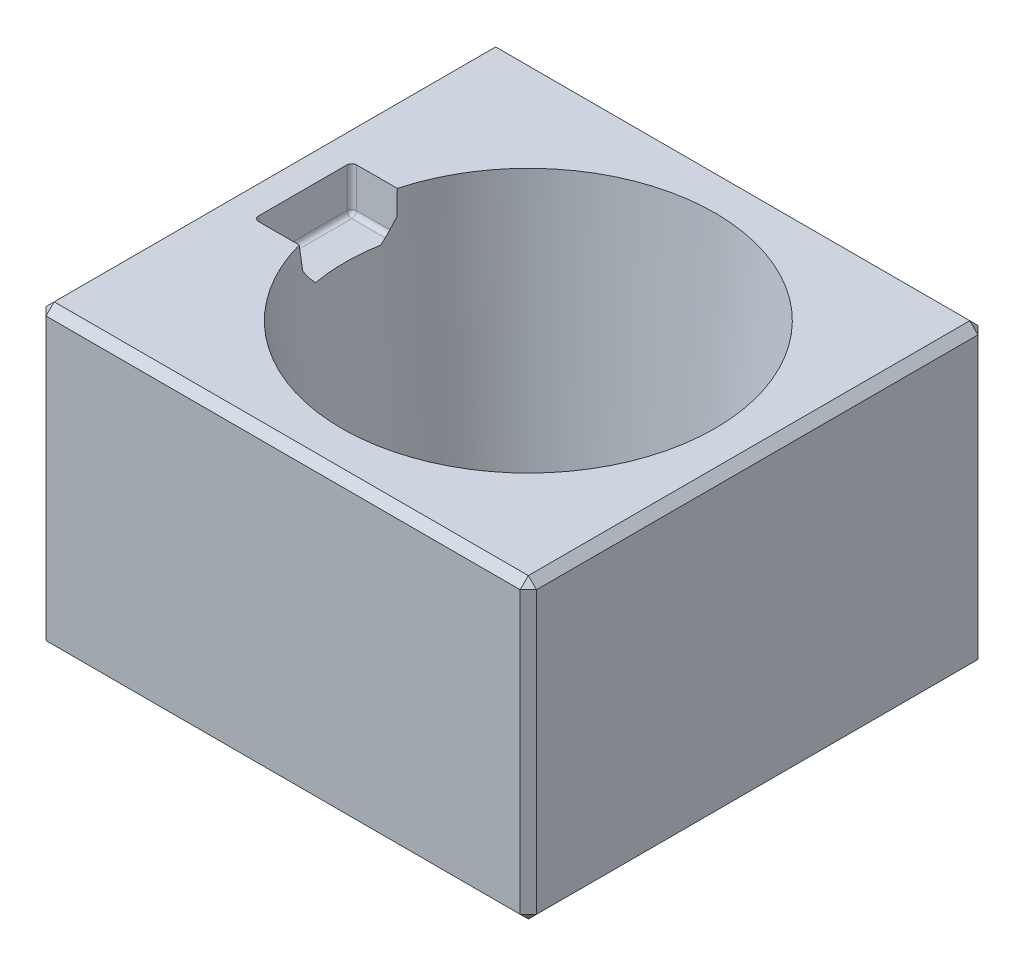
ISO-10303-21;
HEADER;
FILE_DESCRIPTION(('STEP AP214'),'2;1');
FILE_NAME('part.step','',(''),(''),'','','');
FILE_SCHEMA(('AUTOMOTIVE_DESIGN { 1 0 10303 214 1 1 1 1 }'));
ENDSEC;
DATA;
#1=APPLICATION_CONTEXT('core data for automotive mechanical design processes');
#2=APPLICATION_PROTOCOL_DEFINITION('international standard','automotive_design',2000,#1);
#3=PRODUCT_CONTEXT('',#1,'mechanical');
#4=PRODUCT('Part','Part','',(#3));
#5=PRODUCT_RELATED_PRODUCT_CATEGORY('part','',(#4));
#6=PRODUCT_DEFINITION_FORMATION('','',#4);
#7=PRODUCT_DEFINITION_CONTEXT('part definition',#1,'design');
#8=PRODUCT_DEFINITION('design','',#6,#7);
#9=PRODUCT_DEFINITION_SHAPE('','',#8);
#10=(LENGTH_UNIT() NAMED_UNIT(*) SI_UNIT(.MILLI.,.METRE.));
#11=(NAMED_UNIT(*) PLANE_ANGLE_UNIT() SI_UNIT($,.RADIAN.));
#12=(NAMED_UNIT(*) SI_UNIT($,.STERADIAN.) SOLID_ANGLE_UNIT());
#13=UNCERTAINTY_MEASURE_WITH_UNIT(LENGTH_MEASURE(1.E-05),#10,'distance_accuracy_value','');
#14=(GEOMETRIC_REPRESENTATION_CONTEXT(3) GLOBAL_UNCERTAINTY_ASSIGNED_CONTEXT((#13)) GLOBAL_UNIT_ASSIGNED_CONTEXT((#10,
#11,#12)) REPRESENTATION_CONTEXT('',''));
#15=CARTESIAN_POINT('',(0.,0.,0.));
#16=DIRECTION('',(0.,0.,1.));
#17=DIRECTION('',(1.,0.,0.));
#18=AXIS2_PLACEMENT_3D('',#15,#16,#17);
#19=CARTESIAN_POINT('',(140.,-100.971659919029,140.));
#20=DIRECTION('',(1.,0.,0.));
#21=DIRECTION('',(0.,1.,0.));
#22=AXIS2_PLACEMENT_3D('',#19,#20,#21);
#23=PLANE('',#22);
#24=DIRECTION('',(0.,-1.,0.));
#25=VECTOR('',#24,1.);
#26=CARTESIAN_POINT('',(140.,-100.971659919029,135.));
#27=LINE('',#26,#25);
#28=CARTESIAN_POINT('',(140.,75.9716599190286,135.));
#29=VERTEX_POINT('',#28);
#30=CARTESIAN_POINT('',(140.,-95.9716599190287,135.));
#31=VERTEX_POINT('',#30);
#32=EDGE_CURVE('E41',#29,#31,#27,.T.);
#33=ORIENTED_EDGE('',*,*,#32,.T.);
#34=DIRECTION('',(0.,0.,-1.));
#35=VECTOR('',#34,1.);
#36=CARTESIAN_POINT('',(140.,-95.9716599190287,-140.));
#37=LINE('',#36,#35);
#38=CARTESIAN_POINT('',(140.,-95.9716599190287,-135.));
#39=VERTEX_POINT('',#38);
#40=EDGE_CURVE('E11',#31,#39,#37,.T.);
#41=ORIENTED_EDGE('',*,*,#40,.T.);
#42=DIRECTION('',(0.,1.,0.));
#43=VECTOR('',#42,1.);
#44=CARTESIAN_POINT('',(140.,-100.971659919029,-135.));
#45=LINE('',#44,#43);
#46=CARTESIAN_POINT('',(140.,75.9716599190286,-135.));
#47=VERTEX_POINT('',#46);
#48=EDGE_CURVE('E383',#39,#47,#45,.T.);
#49=ORIENTED_EDGE('',*,*,#48,.T.);
#50=DIRECTION('',(0.,0.,1.));
#51=VECTOR('',#50,1.);
#52=CARTESIAN_POINT('',(140.,75.9716599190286,140.));
#53=LINE('',#52,#51);
#54=EDGE_CURVE('E52',#47,#29,#53,.T.);
#55=ORIENTED_EDGE('',*,*,#54,.T.);
#56=EDGE_LOOP('',(#33,#41,#49,#55));
#57=FACE_BOUND('',#56,.T.);
#58=ADVANCED_FACE('F32',(#57),#23,.T.);
#59=CARTESIAN_POINT('',(140.,-100.971659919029,140.));
#60=DIRECTION('',(0.,0.,1.));
#61=DIRECTION('',(1.,0.,0.));
#62=AXIS2_PLACEMENT_3D('',#59,#60,#61);
#63=PLANE('',#62);
#64=DIRECTION('',(-1.,0.,0.));
#65=VECTOR('',#64,1.);
#66=CARTESIAN_POINT('',(-160.,75.9716599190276,140.));
#67=LINE('',#66,#65);
#68=CARTESIAN_POINT('',(135.,75.9716599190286,140.));
#69=VERTEX_POINT('',#68);
#70=CARTESIAN_POINT('',(-155.,75.9716599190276,140.));
#71=VERTEX_POINT('',#70);
#72=EDGE_CURVE('E374',#69,#71,#67,.T.);
#73=ORIENTED_EDGE('',*,*,#72,.T.);
#74=DIRECTION('',(0.,-1.,0.));
#75=VECTOR('',#74,1.);
#76=CARTESIAN_POINT('',(-155.,-100.971659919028,140.));
#77=LINE('',#76,#75);
#78=CARTESIAN_POINT('',(-155.,-95.9716599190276,140.));
#79=VERTEX_POINT('',#78);
#80=EDGE_CURVE('E380',#71,#79,#77,.T.);
#81=ORIENTED_EDGE('',*,*,#80,.T.);
#82=DIRECTION('',(1.,0.,0.));
#83=VECTOR('',#82,1.);
#84=CARTESIAN_POINT('',(140.,-95.9716599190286,140.));
#85=LINE('',#84,#83);
#86=CARTESIAN_POINT('',(135.,-95.9716599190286,140.));
#87=VERTEX_POINT('',#86);
#88=EDGE_CURVE('E378',#79,#87,#85,.T.);
#89=ORIENTED_EDGE('',*,*,#88,.T.);
#90=DIRECTION('',(0.,1.,0.));
#91=VECTOR('',#90,1.);
#92=CARTESIAN_POINT('',(135.,-100.971659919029,140.));
#93=LINE('',#92,#91);
#94=EDGE_CURVE('E376',#87,#69,#93,.T.);
#95=ORIENTED_EDGE('',*,*,#94,.T.);
#96=EDGE_LOOP('',(#73,#81,#89,#95));
#97=FACE_BOUND('',#96,.T.);
#98=ADVANCED_FACE('F460',(#97),#63,.T.);
#99=CARTESIAN_POINT('',(-160.,-100.971659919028,140.));
#100=DIRECTION('',(-1.,0.,0.));
#101=DIRECTION('',(0.,-1.,0.));
#102=AXIS2_PLACEMENT_3D('',#99,#100,#101);
#103=PLANE('',#102);
#104=DIRECTION('',(0.,-1.,0.));
#105=VECTOR('',#104,1.);
#106=CARTESIAN_POINT('',(-160.,-100.971659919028,-135.));
#107=LINE('',#106,#105);
#108=CARTESIAN_POINT('',(-160.,75.9716599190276,-135.));
#109=VERTEX_POINT('',#108);
#110=CARTESIAN_POINT('',(-160.,-95.9716599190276,-135.));
#111=VERTEX_POINT('',#110);
#112=EDGE_CURVE('E342',#109,#111,#107,.T.);
#113=ORIENTED_EDGE('',*,*,#112,.T.);
#114=DIRECTION('',(0.,0.,1.));
#115=VECTOR('',#114,1.);
#116=CARTESIAN_POINT('',(-160.,-95.9716599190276,140.));
#117=LINE('',#116,#115);
#118=CARTESIAN_POINT('',(-160.,-95.9716599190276,135.));
#119=VERTEX_POINT('',#118);
#120=EDGE_CURVE('E344',#111,#119,#117,.T.);
#121=ORIENTED_EDGE('',*,*,#120,.T.);
#122=DIRECTION('',(0.,1.,0.));
#123=VECTOR('',#122,1.);
#124=CARTESIAN_POINT('',(-160.,-100.971659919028,135.));
#125=LINE('',#124,#123);
#126=CARTESIAN_POINT('',(-160.,75.9716599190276,135.));
#127=VERTEX_POINT('',#126);
#128=EDGE_CURVE('E320',#119,#127,#125,.T.);
#129=ORIENTED_EDGE('',*,*,#128,.T.);
#130=DIRECTION('',(0.,0.,-1.));
#131=VECTOR('',#130,1.);
#132=CARTESIAN_POINT('',(-160.,75.9716599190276,-140.));
#133=LINE('',#132,#131);
#134=EDGE_CURVE('E340',#127,#109,#133,.T.);
#135=ORIENTED_EDGE('',*,*,#134,.T.);
#136=EDGE_LOOP('',(#113,#121,#129,#135));
#137=FACE_BOUND('',#136,.T.);
#138=ADVANCED_FACE('F541',(#137),#103,.T.);
#139=CARTESIAN_POINT('',(140.,-100.971659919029,-140.));
#140=DIRECTION('',(0.,0.,-1.));
#141=DIRECTION('',(-1.,0.,0.));
#142=AXIS2_PLACEMENT_3D('',#139,#140,#141);
#143=PLANE('',#142);
#144=DIRECTION('',(-1.,0.,0.));
#145=VECTOR('',#144,1.);
#146=CARTESIAN_POINT('',(-160.,-95.9716599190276,-140.));
#147=LINE('',#146,#145);
#148=CARTESIAN_POINT('',(135.,-95.9716599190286,-140.));
#149=VERTEX_POINT('',#148);
#150=CARTESIAN_POINT('',(-155.,-95.9716599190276,-140.));
#151=VERTEX_POINT('',#150);
#152=EDGE_CURVE('E360',#149,#151,#147,.T.);
#153=ORIENTED_EDGE('',*,*,#152,.T.);
#154=DIRECTION('',(0.,1.,0.));
#155=VECTOR('',#154,1.);
#156=CARTESIAN_POINT('',(-155.,-100.971659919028,-140.));
#157=LINE('',#156,#155);
#158=CARTESIAN_POINT('',(-155.,75.9716599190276,-140.));
#159=VERTEX_POINT('',#158);
#160=EDGE_CURVE('E362',#151,#159,#157,.T.);
#161=ORIENTED_EDGE('',*,*,#160,.T.);
#162=DIRECTION('',(1.,0.,0.));
#163=VECTOR('',#162,1.);
#164=CARTESIAN_POINT('',(140.000000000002,75.9716599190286,-140.));
#165=LINE('',#164,#163);
#166=CARTESIAN_POINT('',(135.,75.9716599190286,-140.));
#167=VERTEX_POINT('',#166);
#168=EDGE_CURVE('E356',#159,#167,#165,.T.);
#169=ORIENTED_EDGE('',*,*,#168,.T.);
#170=DIRECTION('',(0.,-1.,0.));
#171=VECTOR('',#170,1.);
#172=CARTESIAN_POINT('',(135.,-100.971659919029,-140.));
#173=LINE('',#172,#171);
#174=EDGE_CURVE('E358',#167,#149,#173,.T.);
#175=ORIENTED_EDGE('',*,*,#174,.T.);
#176=EDGE_LOOP('',(#153,#161,#169,#175));
#177=FACE_BOUND('',#176,.T.);
#178=ADVANCED_FACE('F489',(#177),#143,.T.);
#179=CARTESIAN_POINT('',(140.,-100.971659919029,-140.));
#180=DIRECTION('',(0.,1.,0.));
#181=DIRECTION('',(-1.,0.,0.));
#182=AXIS2_PLACEMENT_3D('',#179,#180,#181);
#183=PLANE('',#182);
#184=DIRECTION('',(0.,0.,1.));
#185=VECTOR('',#184,1.);
#186=CARTESIAN_POINT('',(135.,-100.971659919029,140.));
#187=LINE('',#186,#185);
#188=CARTESIAN_POINT('',(135.,-100.971659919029,-135.));
#189=VERTEX_POINT('',#188);
#190=CARTESIAN_POINT('',(135.,-100.971659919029,135.));
#191=VERTEX_POINT('',#190);
#192=EDGE_CURVE('E349',#189,#191,#187,.T.);
#193=ORIENTED_EDGE('',*,*,#192,.T.);
#194=DIRECTION('',(-1.,0.,0.));
#195=VECTOR('',#194,1.);
#196=CARTESIAN_POINT('',(-160.,-100.971659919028,135.));
#197=LINE('',#196,#195);
#198=CARTESIAN_POINT('',(-155.,-100.971659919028,135.));
#199=VERTEX_POINT('',#198);
#200=EDGE_CURVE('E354',#191,#199,#197,.T.);
#201=ORIENTED_EDGE('',*,*,#200,.T.);
#202=DIRECTION('',(0.,0.,-1.));
#203=VECTOR('',#202,1.);
#204=CARTESIAN_POINT('',(-155.,-100.971659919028,-140.));
#205=LINE('',#204,#203);
#206=CARTESIAN_POINT('',(-155.,-100.971659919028,-135.));
#207=VERTEX_POINT('',#206);
#208=EDGE_CURVE('E351',#199,#207,#205,.T.);
#209=ORIENTED_EDGE('',*,*,#208,.T.);
#210=DIRECTION('',(1.,0.,0.));
#211=VECTOR('',#210,1.);
#212=CARTESIAN_POINT('',(140.,-100.971659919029,-135.));
#213=LINE('',#212,#211);
#214=EDGE_CURVE('E347',#207,#189,#213,.T.);
#215=ORIENTED_EDGE('',*,*,#214,.T.);
#216=EDGE_LOOP('',(#193,#201,#209,#215));
#217=FACE_BOUND('',#216,.T.);
#218=ADVANCED_FACE('F519',(#217),#183,.F.);
#219=CARTESIAN_POINT('',(67.8137651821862,80.9716599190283,0.));
#220=DIRECTION('',(0.,-1.,0.));
#221=DIRECTION('',(1.,0.,0.));
#222=AXIS2_PLACEMENT_3D('',#219,#220,#221);
#223=PLANE('',#222);
#224=DIRECTION('',(-1.,0.,0.));
#225=VECTOR('',#224,1.);
#226=CARTESIAN_POINT('',(-160.,80.9716599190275,-135.));
#227=LINE('',#226,#225);
#228=CARTESIAN_POINT('',(135.,80.9716599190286,-135.));
#229=VERTEX_POINT('',#228);
#230=CARTESIAN_POINT('',(-155.,80.9716599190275,-135.));
#231=VERTEX_POINT('',#230);
#232=EDGE_CURVE('E365',#229,#231,#227,.T.);
#233=ORIENTED_EDGE('',*,*,#232,.T.);
#234=DIRECTION('',(0.,0.,1.));
#235=VECTOR('',#234,1.);
#236=CARTESIAN_POINT('',(-155.,80.9716599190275,140.));
#237=LINE('',#236,#235);
#238=CARTESIAN_POINT('',(-155.,80.9716599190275,135.));
#239=VERTEX_POINT('',#238);
#240=EDGE_CURVE('E371',#231,#239,#237,.T.);
#241=ORIENTED_EDGE('',*,*,#240,.T.);
#242=DIRECTION('',(1.,0.,0.));
#243=VECTOR('',#242,1.);
#244=CARTESIAN_POINT('',(140.000000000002,80.9716599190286,135.));
#245=LINE('',#244,#243);
#246=CARTESIAN_POINT('',(135.,80.9716599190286,135.));
#247=VERTEX_POINT('',#246);
#248=EDGE_CURVE('E369',#239,#247,#245,.T.);
#249=ORIENTED_EDGE('',*,*,#248,.T.);
#250=DIRECTION('',(0.,0.,-1.));
#251=VECTOR('',#250,1.);
#252=CARTESIAN_POINT('',(135.,80.9716599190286,-140.));
#253=LINE('',#252,#251);
#254=EDGE_CURVE('E367',#247,#229,#253,.T.);
#255=ORIENTED_EDGE('',*,*,#254,.T.);
#256=EDGE_LOOP('',(#233,#241,#249,#255));
#257=FACE_BOUND('',#256,.T.);
#258=CARTESIAN_POINT('',(3.52148865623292E-13,80.9716599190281,0.));
#259=DIRECTION('',(0.,-1.,0.));
#260=DIRECTION('',(1.,0.,0.));
#261=AXIS2_PLACEMENT_3D('',#258,#259,#260);
#262=CIRCLE('',#261,114.168204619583);
#263=CARTESIAN_POINT('',(-110.156157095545,80.9716599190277,30.0000000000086));
#264=VERTEX_POINT('',#263);
#265=CARTESIAN_POINT('',(-110.156157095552,80.9716599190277,-29.9999999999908));
#266=VERTEX_POINT('',#265);
#267=EDGE_CURVE('E957',#264,#266,#262,.F.);
#268=ORIENTED_EDGE('',*,*,#267,.F.);
#269=DIRECTION('',(1.,0.,0.));
#270=VECTOR('',#269,1.);
#271=CARTESIAN_POINT('',(-108.,80.9716599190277,30.0000000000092));
#272=LINE('',#271,#270);
#273=CARTESIAN_POINT('',(-135.011415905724,80.9716599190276,30.0000000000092));
#274=VERTEX_POINT('',#273);
#275=EDGE_CURVE('E987',#274,#264,#272,.T.);
#276=ORIENTED_EDGE('',*,*,#275,.F.);
#277=CARTESIAN_POINT('',(-134.98854048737,80.9716599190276,26.9885404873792));
#278=DIRECTION('',(0.,-1.,0.));
#279=DIRECTION('',(-0.707106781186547,0.,0.707106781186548));
#280=AXIS2_PLACEMENT_3D('',#277,#278,#279);
#281=ELLIPSE('',#280,3.02287558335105,3.);
#282=CARTESIAN_POINT('',(-138.,80.9716599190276,27.011415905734));
#283=VERTEX_POINT('',#282);
#284=EDGE_CURVE('E304',#283,#274,#281,.F.);
#285=ORIENTED_EDGE('',*,*,#284,.F.);
#286=DIRECTION('',(0.,0.,1.));
#287=VECTOR('',#286,1.);
#288=CARTESIAN_POINT('',(-138.,80.9716599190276,30.0000000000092));
#289=LINE('',#288,#287);
#290=CARTESIAN_POINT('',(-138.,80.9716599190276,-27.0114159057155));
#291=VERTEX_POINT('',#290);
#292=EDGE_CURVE('E989',#291,#283,#289,.T.);
#293=ORIENTED_EDGE('',*,*,#292,.F.);
#294=CARTESIAN_POINT('',(-134.98854048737,80.9716599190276,-26.9885404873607));
#295=DIRECTION('',(0.,-1.,0.));
#296=DIRECTION('',(-0.707106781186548,0.,-0.707106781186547));
#297=AXIS2_PLACEMENT_3D('',#294,#295,#296);
#298=ELLIPSE('',#297,3.02287558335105,3.);
#299=CARTESIAN_POINT('',(-135.011415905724,80.9716599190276,-29.9999999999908));
#300=VERTEX_POINT('',#299);
#301=EDGE_CURVE('E306',#300,#291,#298,.F.);
#302=ORIENTED_EDGE('',*,*,#301,.F.);
#303=DIRECTION('',(-1.,0.,0.));
#304=VECTOR('',#303,1.);
#305=CARTESIAN_POINT('',(-108.,80.9716599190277,-29.9999999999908));
#306=LINE('',#305,#304);
#307=EDGE_CURVE('E338',#266,#300,#306,.T.);
#308=ORIENTED_EDGE('',*,*,#307,.F.);
#309=EDGE_LOOP('',(#268,#276,#285,#293,#302,#308));
#310=FACE_BOUND('',#309,.T.);
#311=ADVANCED_FACE('F498',(#257,#310),#223,.F.);
#312=CARTESIAN_POINT('',(-2.8275992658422E-13,-80.9716599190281,0.));
#313=DIRECTION('',(0.,-1.,0.));
#314=DIRECTION('',(1.,0.,0.));
#315=AXIS2_PLACEMENT_3D('',#312,#313,#314);
#316=PLANE('',#315);
#317=CARTESIAN_POINT('',(-2.8275992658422E-13,-80.9716599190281,0.));
#318=DIRECTION('',(0.,-1.,0.));
#319=DIRECTION('',(1.,0.,0.));
#320=AXIS2_PLACEMENT_3D('',#317,#318,#319);
#321=CIRCLE('',#320,100.);
#322=CARTESIAN_POINT('',(99.9999999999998,-80.9716599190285,0.));
#323=VERTEX_POINT('',#322);
#324=EDGE_CURVE('E952',#323,#323,#321,.T.);
#325=ORIENTED_EDGE('',*,*,#324,.F.);
#326=EDGE_LOOP('',(#325));
#327=FACE_BOUND('',#326,.T.);
#328=CARTESIAN_POINT('',(0.,-80.9716599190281,0.));
#329=DIRECTION('',(0.,1.,0.));
#330=DIRECTION('',(-1.,0.,0.));
#331=AXIS2_PLACEMENT_3D('',#328,#329,#330);
#332=CIRCLE('',#331,75.910931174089);
#333=CARTESIAN_POINT('',(-75.910931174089,-80.9716599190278,0.));
#334=VERTEX_POINT('',#333);
#335=EDGE_CURVE('E955',#334,#334,#332,.T.);
#336=ORIENTED_EDGE('',*,*,#335,.F.);
#337=EDGE_LOOP('',(#336));
#338=FACE_BOUND('',#337,.T.);
#339=ADVANCED_FACE('F276',(#327,#338),#316,.F.);
#340=CARTESIAN_POINT('',(-2.8275992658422E-13,-80.9716599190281,0.));
#341=DIRECTION('',(0.,1.,0.));
#342=DIRECTION('',(1.,0.,0.));
#343=AXIS2_PLACEMENT_3D('',#340,#341,#342);
#344=CONICAL_SURFACE('',#343,100.,0.0872664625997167);
#345=CARTESIAN_POINT('',(-108.472060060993,55.9714599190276,27.8127659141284));
#346=CARTESIAN_POINT('',(-108.754897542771,60.1380493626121,28.1772952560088));
#347=CARTESIAN_POINT('',(-109.036658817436,64.3047107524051,28.5418308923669));
#348=CARTESIAN_POINT('',(-109.598028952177,72.638177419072,29.2709147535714));
#349=CARTESIAN_POINT('',(-109.877637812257,76.8049826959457,29.6354629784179));
#350=CARTESIAN_POINT('',(-110.156170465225,80.9718599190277,30.0000174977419));
#351=B_SPLINE_CURVE_WITH_KNOTS('',3,(#345,#346,#347,#348,#349,#350),.UNSPECIFIED.,.F.,.F.,(4,2,
4),(0.,12.5761713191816,25.1523426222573),.UNSPECIFIED.);
#352=CARTESIAN_POINT('',(-109.220000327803,67.0269923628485,28.7799996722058));
#353=VERTEX_POINT('',#352);
#354=EDGE_CURVE('E284',#353,#264,#351,.T.);
#355=ORIENTED_EDGE('',*,*,#354,.T.);
#356=ORIENTED_EDGE('',*,*,#267,.T.);
#357=CARTESIAN_POINT('',(-110.15617046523,80.9718599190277,-30.0000174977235));
#358=CARTESIAN_POINT('',(-109.877637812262,76.8049826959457,-29.6354629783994));
#359=CARTESIAN_POINT('',(-109.598028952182,72.638177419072,-29.270914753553));
#360=CARTESIAN_POINT('',(-109.036658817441,64.3047107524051,-28.5418308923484));
#361=CARTESIAN_POINT('',(-108.754897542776,60.1380493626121,-28.1772952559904));
#362=CARTESIAN_POINT('',(-108.472060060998,55.9714599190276,-27.81276591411));
#363=B_SPLINE_CURVE_WITH_KNOTS('',3,(#357,#358,#359,#360,#361,#362),.UNSPECIFIED.,.F.,.F.,(4,2,
4),(0.,12.5761713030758,25.1523426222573),.UNSPECIFIED.);
#364=CARTESIAN_POINT('',(-109.220000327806,67.0269923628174,-28.7799996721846));
#365=VERTEX_POINT('',#364);
#366=EDGE_CURVE('E265',#266,#365,#363,.T.);
#367=ORIENTED_EDGE('',*,*,#366,.T.);
#368=CARTESIAN_POINT('',(-109.058582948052,68.8720014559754,-30.0001999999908));
#369=CARTESIAN_POINT('',(-109.108702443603,68.2991330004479,-29.6290206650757));
#370=CARTESIAN_POINT('',(-109.158548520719,67.7293897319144,-29.2530145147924));
#371=CARTESIAN_POINT('',(-109.257634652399,66.5968300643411,-28.4905520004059));
#372=CARTESIAN_POINT('',(-109.306874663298,66.0340141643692,-28.1040948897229));
#373=CARTESIAN_POINT('',(-109.453348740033,64.3598078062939,-26.9298355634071));
#374=CARTESIAN_POINT('',(-109.549580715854,63.2598712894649,-26.125351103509));
#375=CARTESIAN_POINT('',(-109.691367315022,61.6392430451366,-24.8800070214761));
#376=CARTESIAN_POINT('',(-109.73821073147,61.1038203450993,-24.458377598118));
#377=CARTESIAN_POINT('',(-109.830920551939,60.044142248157,-23.6012294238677));
#378=CARTESIAN_POINT('',(-109.876787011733,59.519886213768,-23.1657114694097));
#379=CARTESIAN_POINT('',(-109.967514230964,58.4828693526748,-22.2786475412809));
#380=CARTESIAN_POINT('',(-110.012372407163,57.9701380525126,-21.8270666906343));
#381=CARTESIAN_POINT('',(-110.100809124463,56.9593017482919,-20.9074996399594));
#382=CARTESIAN_POINT('',(-110.144387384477,56.4611999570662,-20.4395098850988));
#383=CARTESIAN_POINT('',(-110.18723408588,55.9714599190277,-19.9627454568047));
#384=B_SPLINE_CURVE_WITH_KNOTS('',3,(#368,#369,#370,#371,#372,#373,#374,#375,#376,#377,#378,
#379,#380,#381,#382,#383),.UNSPECIFIED.,.F.,.F.,(4,2,2,2,2,2,2,4),(0.,2.05326249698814,
4.10667206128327,8.20352528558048,10.2526816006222,12.3017206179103,14.355518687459,
16.4097644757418),.UNSPECIFIED.);
#385=CARTESIAN_POINT('',(-110.187216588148,55.9716599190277,-19.9629401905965));
#386=VERTEX_POINT('',#385);
#387=EDGE_CURVE('E260',#365,#386,#384,.T.);
#388=ORIENTED_EDGE('',*,*,#387,.T.);
#389=CARTESIAN_POINT('',(-1.71390679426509E-12,55.9716599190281,0.));
#390=DIRECTION('',(0.,1.,0.));
#391=DIRECTION('',(-1.,0.,0.));
#392=AXIS2_PLACEMENT_3D('',#389,#390,#391);
#393=CIRCLE('',#392,111.980988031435);
#394=CARTESIAN_POINT('',(-110.187216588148,55.9716599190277,19.9629401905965));
#395=VERTEX_POINT('',#394);
#396=EDGE_CURVE('E969',#395,#386,#393,.F.);
#397=ORIENTED_EDGE('',*,*,#396,.F.);
#398=CARTESIAN_POINT('',(-110.18723408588,55.9714599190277,19.9627454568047));
#399=CARTESIAN_POINT('',(-110.144387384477,56.4611999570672,20.4395098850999));
#400=CARTESIAN_POINT('',(-110.100809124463,56.959301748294,20.9074996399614));
#401=CARTESIAN_POINT('',(-110.012372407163,57.9701380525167,21.8270666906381));
#402=CARTESIAN_POINT('',(-109.967514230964,58.4828693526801,22.2786475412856));
#403=CARTESIAN_POINT('',(-109.876787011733,59.5198862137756,23.1657114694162));
#404=CARTESIAN_POINT('',(-109.830920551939,60.0441422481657,23.601229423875));
#405=CARTESIAN_POINT('',(-109.738210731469,61.1038203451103,24.4583775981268));
#406=CARTESIAN_POINT('',(-109.691367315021,61.6392430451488,24.8800070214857));
#407=CARTESIAN_POINT('',(-109.549580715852,63.2598712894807,26.1253511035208));
#408=CARTESIAN_POINT('',(-109.453348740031,64.3598078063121,26.9298355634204));
#409=CARTESIAN_POINT('',(-109.306874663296,66.0340141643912,28.1040948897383));
#410=CARTESIAN_POINT('',(-109.257634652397,66.5968300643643,28.4905520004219));
#411=CARTESIAN_POINT('',(-109.158548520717,67.7293897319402,29.2530145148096));
#412=CARTESIAN_POINT('',(-109.1087024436,68.299133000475,29.6290206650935));
#413=CARTESIAN_POINT('',(-109.05858294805,68.8720014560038,30.0002000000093));
#414=B_SPLINE_CURVE_WITH_KNOTS('',3,(#398,#399,#400,#401,#402,#403,#404,#405,#406,#407,#408,
#409,#410,#411,#412,#413),.UNSPECIFIED.,.F.,.F.,(4,2,2,2,2,2,2,4),(0.,2.05424578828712,
4.10804385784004,6.15708287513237,8.20623919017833,12.303092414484,14.3565019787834,
16.4097644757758),.UNSPECIFIED.);
#415=EDGE_CURVE('E253',#395,#353,#414,.T.);
#416=ORIENTED_EDGE('',*,*,#415,.T.);
#417=EDGE_LOOP('',(#355,#356,#367,#388,#397,#416));
#418=FACE_BOUND('',#417,.T.);
#419=ORIENTED_EDGE('',*,*,#324,.T.);
#420=EDGE_LOOP('',(#419));
#421=FACE_BOUND('',#420,.T.);
#422=ADVANCED_FACE('F270',(#418,#421),#344,.F.);
#423=CARTESIAN_POINT('',(1.09287578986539E-13,-66.809028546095,0.));
#424=DIRECTION('',(0.,-1.,0.));
#425=DIRECTION('',(-1.,0.,0.));
#426=AXIS2_PLACEMENT_3D('',#423,#424,#425);
#427=CONICAL_SURFACE('',#426,75.4163611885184,0.034906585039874);
#428=CARTESIAN_POINT('',(1.00613961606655E-13,-69.498226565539,0.));
#429=DIRECTION('',(0.,1.,0.));
#430=DIRECTION('',(-1.,0.,0.));
#431=AXIS2_PLACEMENT_3D('',#428,#429,#430);
#432=CIRCLE('',#431,75.510270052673);
#433=CARTESIAN_POINT('',(-75.5102700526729,-69.4982265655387,0.));
#434=VERTEX_POINT('',#433);
#435=EDGE_CURVE('E976',#434,#434,#432,.F.);
#436=ORIENTED_EDGE('',*,*,#435,.T.);
#437=EDGE_LOOP('',(#436));
#438=FACE_BOUND('',#437,.T.);
#439=ORIENTED_EDGE('',*,*,#335,.T.);
#440=EDGE_LOOP('',(#439));
#441=FACE_BOUND('',#440,.T.);
#442=ADVANCED_FACE('F275',(#438,#441),#427,.T.);
#443=CARTESIAN_POINT('',(1.30104260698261E-13,-60.9915749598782,0.));
#444=DIRECTION('',(0.,-1.,0.));
#445=DIRECTION('',(-1.,0.,0.));
#446=AXIS2_PLACEMENT_3D('',#443,#444,#445);
#447=CONICAL_SURFACE('',#446,66.1064893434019,1.01229096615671);
#448=CARTESIAN_POINT('',(1.14491749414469E-13,-65.3831020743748,0.));
#449=DIRECTION('',(0.,1.,0.));
#450=DIRECTION('',(-1.,0.,0.));
#451=AXIS2_PLACEMENT_3D('',#448,#449,#450);
#452=CIRCLE('',#451,73.1344018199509);
#453=CARTESIAN_POINT('',(-73.1344018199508,-65.3831020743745,0.));
#454=VERTEX_POINT('',#453);
#455=EDGE_CURVE('E971',#454,#454,#452,.T.);
#456=ORIENTED_EDGE('',*,*,#455,.T.);
#457=EDGE_LOOP('',(#456));
#458=FACE_BOUND('',#457,.T.);
#459=CARTESIAN_POINT('',(1.30104260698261E-13,-60.9915749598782,0.));
#460=DIRECTION('',(0.,1.,0.));
#461=DIRECTION('',(-1.,0.,0.));
#462=AXIS2_PLACEMENT_3D('',#459,#460,#461);
#463=CIRCLE('',#462,66.1064893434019);
#464=CARTESIAN_POINT('',(-66.1064893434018,-60.991574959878,0.));
#465=VERTEX_POINT('',#464);
#466=EDGE_CURVE('E960',#465,#465,#463,.T.);
#467=ORIENTED_EDGE('',*,*,#466,.F.);
#468=EDGE_LOOP('',(#467));
#469=FACE_BOUND('',#468,.T.);
#470=ADVANCED_FACE('F840',(#458,#469),#447,.T.);
#471=CARTESIAN_POINT('',(1.54390389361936E-13,-54.1247887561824,0.));
#472=DIRECTION('',(0.,-1.,0.));
#473=DIRECTION('',(-1.,0.,0.));
#474=AXIS2_PLACEMENT_3D('',#471,#472,#473);
#475=TOROIDAL_SURFACE('',#474,70.3973335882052,8.09716599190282);
#476=CARTESIAN_POINT('',(1.38777878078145E-13,-58.5367049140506,0.));
#477=DIRECTION('',(0.,1.,0.));
#478=DIRECTION('',(-1.,0.,0.));
#479=AXIS2_PLACEMENT_3D('',#476,#477,#478);
#480=CIRCLE('',#479,63.6077023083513);
#481=CARTESIAN_POINT('',(-63.6077023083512,-58.5367049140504,0.));
#482=VERTEX_POINT('',#481);
#483=EDGE_CURVE('E966',#482,#482,#480,.F.);
#484=ORIENTED_EDGE('',*,*,#483,.T.);
#485=EDGE_LOOP('',(#484));
#486=FACE_BOUND('',#485,.T.);
#487=ORIENTED_EDGE('',*,*,#466,.T.);
#488=EDGE_LOOP('',(#487));
#489=FACE_BOUND('',#488,.T.);
#490=ADVANCED_FACE('F832',(#486,#489),#475,.F.);
#491=CARTESIAN_POINT('',(0.,-91.6260760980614,0.));
#492=DIRECTION('',(0.,-1.,0.));
#493=DIRECTION('',(1.,0.,0.));
#494=AXIS2_PLACEMENT_3D('',#491,#492,#493);
#495=DEGENERATE_TOROIDAL_SURFACE('',#494,12.6854677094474,60.7287449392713,.T.);
#496=ORIENTED_EDGE('',*,*,#483,.F.);
#497=EDGE_LOOP('',(#496));
#498=FACE_BOUND('',#497,.T.);
#499=CARTESIAN_POINT('',(1.56497200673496E-13,-52.4707087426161,0.));
#500=DIRECTION('',(0.,-1.,0.));
#501=DIRECTION('',(1.,0.,0.));
#502=AXIS2_PLACEMENT_3D('',#499,#500,#501);
#503=CIRCLE('',#502,59.10569680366);
#504=CARTESIAN_POINT('',(59.1056968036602,-52.4707087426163,0.));
#505=VERTEX_POINT('',#504);
#506=EDGE_CURVE('E222',#505,#505,#503,.F.);
#507=ORIENTED_EDGE('',*,*,#506,.F.);
#508=EDGE_LOOP('',(#507));
#509=FACE_BOUND('',#508,.T.);
#510=ADVANCED_FACE('F824',(#498,#509),#495,.T.);
#511=CARTESIAN_POINT('',(1.00613961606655E-13,-69.6748434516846,0.));
#512=DIRECTION('',(0.,-1.,0.));
#513=DIRECTION('',(1.,0.,0.));
#514=AXIS2_PLACEMENT_3D('',#511,#512,#513);
#515=TOROIDAL_SURFACE('',#514,70.4526241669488,5.06072874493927);
#516=ORIENTED_EDGE('',*,*,#435,.F.);
#517=EDGE_LOOP('',(#516));
#518=FACE_BOUND('',#517,.T.);
#519=ORIENTED_EDGE('',*,*,#455,.F.);
#520=EDGE_LOOP('',(#519));
#521=FACE_BOUND('',#520,.T.);
#522=ADVANCED_FACE('F279',(#518,#521),#515,.T.);
#523=CARTESIAN_POINT('',(-108.,80.9716599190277,30.0000000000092));
#524=DIRECTION('',(0.996194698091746,-0.0871557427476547,0.));
#525=DIRECTION('',(0.0871557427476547,0.996194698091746,0.));
#526=AXIS2_PLACEMENT_3D('',#523,#524,#525);
#527=PLANE('',#526);
#528=DIRECTION('',(0.,0.,-1.));
#529=VECTOR('',#528,1.);
#530=CARTESIAN_POINT('',(-110.187216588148,55.9716599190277,-29.9999999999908));
#531=LINE('',#530,#529);
#532=CARTESIAN_POINT('',(-110.187216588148,55.9716599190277,-25.0637898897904));
#533=VERTEX_POINT('',#532);
#534=EDGE_CURVE('E984',#386,#533,#531,.T.);
#535=ORIENTED_EDGE('',*,*,#534,.F.);
#536=ORIENTED_EDGE('',*,*,#387,.F.);
#537=DIRECTION('',(0.0868265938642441,0.992432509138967,-0.0868265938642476));
#538=VECTOR('',#537,1.);
#539=CARTESIAN_POINT('',(-108.452331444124,75.8014878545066,-29.5476685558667));
#540=LINE('',#539,#538);
#541=CARTESIAN_POINT('',(-109.947626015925,58.7101926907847,-28.0523739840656));
#542=VERTEX_POINT('',#541);
#543=EDGE_CURVE('E983',#542,#365,#540,.T.);
#544=ORIENTED_EDGE('',*,*,#543,.F.);
#545=CARTESIAN_POINT('',(-109.92475059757,58.9716599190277,-25.0637898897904));
#546=DIRECTION('',(0.996194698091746,-0.0871557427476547,0.));
#547=DIRECTION('',(0.0871557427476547,0.996194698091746,0.));
#548=AXIS2_PLACEMENT_3D('',#545,#546,#547);
#549=ELLIPSE('',#548,3.01145951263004,3.);
#550=EDGE_CURVE('E302',#533,#542,#549,.T.);
#551=ORIENTED_EDGE('',*,*,#550,.F.);
#552=EDGE_LOOP('',(#535,#536,#544,#551));
#553=FACE_BOUND('',#552,.T.);
#554=ADVANCED_FACE('F247',(#553),#527,.F.);
#555=DIRECTION('',(0.0868265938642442,0.992432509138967,0.0868265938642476));
#556=VECTOR('',#555,1.);
#557=CARTESIAN_POINT('',(-108.,80.9716599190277,30.0000000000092));
#558=LINE('',#557,#556);
#559=CARTESIAN_POINT('',(-109.947626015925,58.7101926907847,28.0523739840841));
#560=VERTEX_POINT('',#559);
#561=EDGE_CURVE('E962',#560,#353,#558,.T.);
#562=ORIENTED_EDGE('',*,*,#561,.T.);
#563=ORIENTED_EDGE('',*,*,#415,.F.);
#564=CARTESIAN_POINT('',(-110.187216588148,55.9716599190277,25.0637898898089));
#565=VERTEX_POINT('',#564);
#566=EDGE_CURVE('E981',#565,#395,#531,.T.);
#567=ORIENTED_EDGE('',*,*,#566,.F.);
#568=CARTESIAN_POINT('',(-109.92475059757,58.9716599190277,25.0637898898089));
#569=DIRECTION('',(0.996194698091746,-0.0871557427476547,0.));
#570=DIRECTION('',(-0.0871557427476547,-0.996194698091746,0.));
#571=AXIS2_PLACEMENT_3D('',#568,#569,#570);
#572=ELLIPSE('',#571,3.01145951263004,3.);
#573=EDGE_CURVE('E318',#560,#565,#572,.T.);
#574=ORIENTED_EDGE('',*,*,#573,.F.);
#575=EDGE_LOOP('',(#562,#563,#567,#574));
#576=FACE_BOUND('',#575,.T.);
#577=ADVANCED_FACE('F242',(#576),#527,.F.);
#578=CARTESIAN_POINT('',(-108.,80.9716599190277,30.0000000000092));
#579=DIRECTION('',(0.,-0.0871557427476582,0.996194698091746));
#580=DIRECTION('',(0.,-0.996194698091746,-0.0871557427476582));
#581=AXIS2_PLACEMENT_3D('',#578,#579,#580);
#582=PLANE('',#581);
#583=DIRECTION('',(-0.0868265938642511,0.992432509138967,0.0868265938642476));
#584=VECTOR('',#583,1.);
#585=CARTESIAN_POINT('',(-134.807780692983,78.6440987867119,29.796364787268));
#586=LINE('',#585,#584);
#587=CARTESIAN_POINT('',(-133.063789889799,58.7101926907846,28.0523739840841));
#588=VERTEX_POINT('',#587);
#589=EDGE_CURVE('E314',#274,#588,#586,.F.);
#590=ORIENTED_EDGE('',*,*,#589,.F.);
#591=ORIENTED_EDGE('',*,*,#275,.T.);
#592=ORIENTED_EDGE('',*,*,#354,.F.);
#593=ORIENTED_EDGE('',*,*,#561,.F.);
#594=DIRECTION('',(1.,0.,0.));
#595=VECTOR('',#594,1.);
#596=CARTESIAN_POINT('',(-110.187216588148,58.7101926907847,28.0523739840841));
#597=LINE('',#596,#595);
#598=EDGE_CURVE('E316',#588,#560,#597,.T.);
#599=ORIENTED_EDGE('',*,*,#598,.F.);
#600=EDGE_LOOP('',(#590,#591,#592,#593,#599));
#601=FACE_BOUND('',#600,.T.);
#602=ADVANCED_FACE('F246',(#601),#582,.F.);
#603=CARTESIAN_POINT('',(-138.,80.9716599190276,30.0000000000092));
#604=DIRECTION('',(-0.996194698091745,-0.0871557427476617,0.));
#605=DIRECTION('',(0.0871557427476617,-0.996194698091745,0.));
#606=AXIS2_PLACEMENT_3D('',#603,#604,#605);
#607=PLANE('',#606);
#608=ORIENTED_EDGE('',*,*,#292,.T.);
#609=DIRECTION('',(-0.0868265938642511,0.992432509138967,0.0868265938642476));
#610=VECTOR('',#609,1.);
#611=CARTESIAN_POINT('',(-138.022530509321,81.2291848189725,27.0339464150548));
#612=LINE('',#611,#610);
#613=CARTESIAN_POINT('',(-136.052373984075,58.7101926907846,25.0637898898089));
#614=VERTEX_POINT('',#613);
#615=EDGE_CURVE('E308',#614,#283,#612,.T.);
#616=ORIENTED_EDGE('',*,*,#615,.F.);
#617=DIRECTION('',(0.,0.,1.));
#618=VECTOR('',#617,1.);
#619=CARTESIAN_POINT('',(-136.052373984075,58.7101926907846,27.8127834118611));
#620=LINE('',#619,#618);
#621=CARTESIAN_POINT('',(-136.052373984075,58.7101926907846,-25.0637898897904));
#622=VERTEX_POINT('',#621);
#623=EDGE_CURVE('E310',#622,#614,#620,.T.);
#624=ORIENTED_EDGE('',*,*,#623,.F.);
#625=DIRECTION('',(-0.0868265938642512,0.992432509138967,-0.0868265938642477));
#626=VECTOR('',#625,1.);
#627=CARTESIAN_POINT('',(-137.570199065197,76.0590127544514,-26.5816149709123));
#628=LINE('',#627,#626);
#629=EDGE_CURVE('E312',#291,#622,#628,.F.);
#630=ORIENTED_EDGE('',*,*,#629,.F.);
#631=EDGE_LOOP('',(#608,#616,#624,#630));
#632=FACE_BOUND('',#631,.T.);
#633=ADVANCED_FACE('F790',(#632),#607,.F.);
#634=CARTESIAN_POINT('',(-108.,80.9716599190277,-29.9999999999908));
#635=DIRECTION('',(0.,-0.0871557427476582,-0.996194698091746));
#636=DIRECTION('',(0.,0.996194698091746,-0.0871557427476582));
#637=AXIS2_PLACEMENT_3D('',#634,#635,#636);
#638=PLANE('',#637);
#639=ORIENTED_EDGE('',*,*,#543,.T.);
#640=ORIENTED_EDGE('',*,*,#366,.F.);
#641=ORIENTED_EDGE('',*,*,#307,.T.);
#642=DIRECTION('',(-0.0868265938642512,0.992432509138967,-0.0868265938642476));
#643=VECTOR('',#642,1.);
#644=CARTESIAN_POINT('',(-134.807780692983,78.6440987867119,-29.7963647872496));
#645=LINE('',#644,#643);
#646=CARTESIAN_POINT('',(-133.063789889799,58.7101926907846,-28.0523739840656));
#647=VERTEX_POINT('',#646);
#648=EDGE_CURVE('E290',#647,#300,#645,.T.);
#649=ORIENTED_EDGE('',*,*,#648,.F.);
#650=DIRECTION('',(-1.,0.,0.));
#651=VECTOR('',#650,1.);
#652=CARTESIAN_POINT('',(-135.812783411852,58.7101926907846,-28.0523739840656));
#653=LINE('',#652,#651);
#654=EDGE_CURVE('E293',#542,#647,#653,.T.);
#655=ORIENTED_EDGE('',*,*,#654,.F.);
#656=EDGE_LOOP('',(#639,#640,#641,#649,#655));
#657=FACE_BOUND('',#656,.T.);
#658=ADVANCED_FACE('F240',(#657),#638,.F.);
#659=CARTESIAN_POINT('',(-108.,55.9716599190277,-29.9999999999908));
#660=DIRECTION('',(0.,1.,0.));
#661=DIRECTION('',(-1.,0.,0.));
#662=AXIS2_PLACEMENT_3D('',#659,#660,#661);
#663=PLANE('',#662);
#664=DIRECTION('',(0.,0.,1.));
#665=VECTOR('',#664,1.);
#666=CARTESIAN_POINT('',(-133.063789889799,55.9716599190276,-27.8127834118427));
#667=LINE('',#666,#665);
#668=CARTESIAN_POINT('',(-133.063789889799,55.9716599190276,25.0637898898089));
#669=VERTEX_POINT('',#668);
#670=CARTESIAN_POINT('',(-133.063789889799,55.9716599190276,-25.0637898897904));
#671=VERTEX_POINT('',#670);
#672=EDGE_CURVE('E298',#669,#671,#667,.F.);
#673=ORIENTED_EDGE('',*,*,#672,.F.);
#674=DIRECTION('',(1.,0.,0.));
#675=VECTOR('',#674,1.);
#676=CARTESIAN_POINT('',(-135.812783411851,55.9716599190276,25.0637898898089));
#677=LINE('',#676,#675);
#678=EDGE_CURVE('E296',#565,#669,#677,.F.);
#679=ORIENTED_EDGE('',*,*,#678,.F.);
#680=ORIENTED_EDGE('',*,*,#566,.T.);
#681=ORIENTED_EDGE('',*,*,#396,.T.);
#682=ORIENTED_EDGE('',*,*,#534,.T.);
#683=DIRECTION('',(-1.,0.,0.));
#684=VECTOR('',#683,1.);
#685=CARTESIAN_POINT('',(-110.187216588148,55.9716599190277,-25.0637898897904));
#686=LINE('',#685,#684);
#687=EDGE_CURVE('E300',#671,#533,#686,.F.);
#688=ORIENTED_EDGE('',*,*,#687,.F.);
#689=EDGE_LOOP('',(#673,#679,#680,#681,#682,#688));
#690=FACE_BOUND('',#689,.T.);
#691=ADVANCED_FACE('F236',(#690),#663,.T.);
#692=CARTESIAN_POINT('',(-135.033946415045,81.4906520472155,27.0339464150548));
#693=DIRECTION('',(-0.0868265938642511,0.992432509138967,0.0868265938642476));
#694=DIRECTION('',(-0.996194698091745,-0.0871557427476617,0.));
#695=AXIS2_PLACEMENT_3D('',#692,#693,#694);
#696=CYLINDRICAL_SURFACE('',#695,3.);
#697=ORIENTED_EDGE('',*,*,#284,.T.);
#698=ORIENTED_EDGE('',*,*,#589,.T.);
#699=CARTESIAN_POINT('',(-133.063789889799,58.9716599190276,25.0637898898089));
#700=DIRECTION('',(0.0868265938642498,-0.992432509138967,-0.0868265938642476));
#701=DIRECTION('',(0.996194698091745,0.0871557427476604,0.));
#702=AXIS2_PLACEMENT_3D('',#699,#700,#701);
#703=CIRCLE('',#702,3.);
#704=EDGE_CURVE('E335',#588,#614,#703,.T.);
#705=ORIENTED_EDGE('',*,*,#704,.T.);
#706=ORIENTED_EDGE('',*,*,#615,.T.);
#707=EDGE_LOOP('',(#697,#698,#705,#706));
#708=FACE_BOUND('',#707,.T.);
#709=ADVANCED_FACE('F239',(#708),#696,.F.);
#710=CARTESIAN_POINT('',(-108.,58.9716599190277,25.0637898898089));
#711=DIRECTION('',(-1.,0.,0.));
#712=DIRECTION('',(0.,-1.,0.));
#713=AXIS2_PLACEMENT_3D('',#710,#711,#712);
#714=CYLINDRICAL_SURFACE('',#713,3.);
#715=ORIENTED_EDGE('',*,*,#573,.T.);
#716=ORIENTED_EDGE('',*,*,#678,.T.);
#717=CARTESIAN_POINT('',(-133.063789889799,58.9716599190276,25.0637898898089));
#718=DIRECTION('',(-1.,0.,0.));
#719=DIRECTION('',(0.,0.,1.));
#720=AXIS2_PLACEMENT_3D('',#717,#718,#719);
#721=CIRCLE('',#720,3.);
#722=EDGE_CURVE('E332',#669,#588,#721,.T.);
#723=ORIENTED_EDGE('',*,*,#722,.T.);
#724=ORIENTED_EDGE('',*,*,#598,.T.);
#725=EDGE_LOOP('',(#715,#716,#723,#724));
#726=FACE_BOUND('',#725,.T.);
#727=ADVANCED_FACE('F760',(#726),#714,.F.);
#728=CARTESIAN_POINT('',(-133.063789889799,58.9716599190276,25.0637898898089));
#729=DIRECTION('',(0.,0.,1.));
#730=DIRECTION('',(1.,0.,0.));
#731=AXIS2_PLACEMENT_3D('',#728,#729,#730);
#732=SPHERICAL_SURFACE('',#731,3.);
#733=ORIENTED_EDGE('',*,*,#722,.F.);
#734=CARTESIAN_POINT('',(-133.063789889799,58.9716599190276,25.0637898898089));
#735=DIRECTION('',(0.,0.,1.));
#736=DIRECTION('',(0.,-1.,0.));
#737=AXIS2_PLACEMENT_3D('',#734,#735,#736);
#738=CIRCLE('',#737,3.);
#739=EDGE_CURVE('E329',#669,#614,#738,.F.);
#740=ORIENTED_EDGE('',*,*,#739,.T.);
#741=ORIENTED_EDGE('',*,*,#704,.F.);
#742=EDGE_LOOP('',(#733,#740,#741));
#743=FACE_BOUND('',#742,.T.);
#744=ADVANCED_FACE('F751',(#743),#732,.F.);
#745=CARTESIAN_POINT('',(-134.807780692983,78.9055660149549,-26.8077806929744));
#746=DIRECTION('',(-0.0868265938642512,0.992432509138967,-0.0868265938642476));
#747=DIRECTION('',(-0.996194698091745,-0.0871557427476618,0.));
#748=AXIS2_PLACEMENT_3D('',#745,#746,#747);
#749=CYLINDRICAL_SURFACE('',#748,3.);
#750=ORIENTED_EDGE('',*,*,#301,.T.);
#751=ORIENTED_EDGE('',*,*,#629,.T.);
#752=CARTESIAN_POINT('',(-133.063789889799,58.9716599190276,-25.0637898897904));
#753=DIRECTION('',(0.086826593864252,-0.992432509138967,0.0868265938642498));
#754=DIRECTION('',(0.996194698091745,0.0871557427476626,0.));
#755=AXIS2_PLACEMENT_3D('',#752,#753,#754);
#756=CIRCLE('',#755,3.);
#757=EDGE_CURVE('E326',#622,#647,#756,.T.);
#758=ORIENTED_EDGE('',*,*,#757,.T.);
#759=ORIENTED_EDGE('',*,*,#648,.T.);
#760=EDGE_LOOP('',(#750,#751,#758,#759));
#761=FACE_BOUND('',#760,.T.);
#762=ADVANCED_FACE('F742',(#761),#749,.F.);
#763=CARTESIAN_POINT('',(-133.063789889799,58.9716599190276,30.0000000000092));
#764=DIRECTION('',(0.,0.,-1.));
#765=DIRECTION('',(-1.,0.,0.));
#766=AXIS2_PLACEMENT_3D('',#763,#764,#765);
#767=CYLINDRICAL_SURFACE('',#766,3.);
#768=ORIENTED_EDGE('',*,*,#739,.F.);
#769=ORIENTED_EDGE('',*,*,#672,.T.);
#770=CARTESIAN_POINT('',(-133.063789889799,58.9716599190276,-25.0637898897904));
#771=DIRECTION('',(0.,0.,-1.));
#772=DIRECTION('',(-1.,0.,0.));
#773=AXIS2_PLACEMENT_3D('',#770,#771,#772);
#774=CIRCLE('',#773,3.);
#775=EDGE_CURVE('E323',#671,#622,#774,.T.);
#776=ORIENTED_EDGE('',*,*,#775,.T.);
#777=ORIENTED_EDGE('',*,*,#623,.T.);
#778=EDGE_LOOP('',(#768,#769,#776,#777));
#779=FACE_BOUND('',#778,.T.);
#780=ADVANCED_FACE('F733',(#779),#767,.F.);
#781=CARTESIAN_POINT('',(-133.063789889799,58.9716599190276,-25.0637898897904));
#782=DIRECTION('',(0.,0.,1.));
#783=DIRECTION('',(1.,0.,0.));
#784=AXIS2_PLACEMENT_3D('',#781,#782,#783);
#785=SPHERICAL_SURFACE('',#784,3.);
#786=ORIENTED_EDGE('',*,*,#775,.F.);
#787=CARTESIAN_POINT('',(-133.063789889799,58.9716599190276,-25.0637898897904));
#788=DIRECTION('',(-1.,0.,0.));
#789=DIRECTION('',(0.,0.,1.));
#790=AXIS2_PLACEMENT_3D('',#787,#788,#789);
#791=CIRCLE('',#790,3.);
#792=EDGE_CURVE('E321',#671,#647,#791,.F.);
#793=ORIENTED_EDGE('',*,*,#792,.T.);
#794=ORIENTED_EDGE('',*,*,#757,.F.);
#795=EDGE_LOOP('',(#786,#793,#794));
#796=FACE_BOUND('',#795,.T.);
#797=ADVANCED_FACE('F724',(#796),#785,.F.);
#798=CARTESIAN_POINT('',(-108.,58.9716599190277,-25.0637898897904));
#799=DIRECTION('',(1.,0.,0.));
#800=DIRECTION('',(0.,1.,0.));
#801=AXIS2_PLACEMENT_3D('',#798,#799,#800);
#802=CYLINDRICAL_SURFACE('',#801,3.);
#803=ORIENTED_EDGE('',*,*,#550,.T.);
#804=ORIENTED_EDGE('',*,*,#654,.T.);
#805=ORIENTED_EDGE('',*,*,#792,.F.);
#806=ORIENTED_EDGE('',*,*,#687,.T.);
#807=EDGE_LOOP('',(#803,#804,#805,#806));
#808=FACE_BOUND('',#807,.T.);
#809=ADVANCED_FACE('F235',(#808),#802,.F.);
#810=CARTESIAN_POINT('',(-1.77171333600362E-13,-52.4707087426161,0.));
#811=DIRECTION('',(0.,-1.,0.));
#812=DIRECTION('',(1.,0.,0.));
#813=AXIS2_PLACEMENT_3D('',#810,#811,#812);
#814=PLANE('',#813);
#815=DIRECTION('',(0.,0.,1.));
#816=VECTOR('',#815,1.);
#817=CARTESIAN_POINT('',(13.9999999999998,-52.4707087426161,-14.2828568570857));
#818=LINE('',#817,#816);
#819=CARTESIAN_POINT('',(13.9999999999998,-52.4707087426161,-14.2828568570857));
#820=VERTEX_POINT('',#819);
#821=CARTESIAN_POINT('',(13.9999999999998,-52.4707087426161,14.2828568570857));
#822=VERTEX_POINT('',#821);
#823=EDGE_CURVE('E207',#820,#822,#818,.T.);
#824=ORIENTED_EDGE('',*,*,#823,.T.);
#825=CARTESIAN_POINT('',(-1.77171333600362E-13,-52.4707087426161,0.));
#826=DIRECTION('',(0.,-1.,0.));
#827=DIRECTION('',(1.,0.,0.));
#828=AXIS2_PLACEMENT_3D('',#825,#826,#827);
#829=CIRCLE('',#828,20.);
#830=EDGE_CURVE('E196',#822,#820,#829,.T.);
#831=ORIENTED_EDGE('',*,*,#830,.T.);
#832=EDGE_LOOP('',(#824,#831));
#833=FACE_BOUND('',#832,.T.);
#834=ORIENTED_EDGE('',*,*,#506,.T.);
#835=EDGE_LOOP('',(#834));
#836=FACE_BOUND('',#835,.T.);
#837=ADVANCED_FACE('F211',(#833,#836),#814,.F.);
#838=CARTESIAN_POINT('',(-1.77171333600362E-13,-52.4707087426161,0.));
#839=DIRECTION('',(0.,-1.,0.));
#840=DIRECTION('',(1.,0.,0.));
#841=AXIS2_PLACEMENT_3D('',#838,#839,#840);
#842=CONICAL_SURFACE('',#841,20.,0.0872664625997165);
#843=ORIENTED_EDGE('',*,*,#830,.F.);
#844=CARTESIAN_POINT('',(11.8127834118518,-27.4707087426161,13.3324191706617));
#845=CARTESIAN_POINT('',(11.9950420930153,-29.5539350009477,13.4144400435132));
#846=CARTESIAN_POINT('',(12.1773033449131,-31.6371906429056,13.4957074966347));
#847=CARTESIAN_POINT('',(12.5418305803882,-35.803756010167,13.6568101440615));
#848=CARTESIAN_POINT('',(12.7240965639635,-37.8870657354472,13.7366453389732));
#849=CARTESIAN_POINT('',(13.0886329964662,-42.0537362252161,13.8949581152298));
#850=CARTESIAN_POINT('',(13.2709034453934,-44.1370969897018,13.9734356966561));
#851=CARTESIAN_POINT('',(13.6354486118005,-48.3038673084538,14.1290988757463));
#852=CARTESIAN_POINT('',(13.8177233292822,-50.3872768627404,14.2062844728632));
#853=CARTESIAN_POINT('',(13.9999999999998,-52.4707087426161,14.2828568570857));
#854=B_SPLINE_CURVE_WITH_KNOTS('',3,(#844,#845,#846,#847,#848,#849,#850,#851,#852,#853),
.UNSPECIFIED.,.F.,.F.,(4,2,2,2,4),(0.,6.2783750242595,12.556747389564,18.8351193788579,
25.1134940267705),.UNSPECIFIED.);
#855=CARTESIAN_POINT('',(11.8127834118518,-27.4707087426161,13.3324191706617));
#856=VERTEX_POINT('',#855);
#857=EDGE_CURVE('E203',#856,#822,#854,.T.);
#858=ORIENTED_EDGE('',*,*,#857,.F.);
#859=CARTESIAN_POINT('',(0.,-27.4707087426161,0.));
#860=DIRECTION('',(0.,-1.,0.));
#861=DIRECTION('',(1.,0.,0.));
#862=AXIS2_PLACEMENT_3D('',#859,#860,#861);
#863=CIRCLE('',#862,17.8127834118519);
#864=CARTESIAN_POINT('',(11.8127834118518,-27.4707087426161,-13.3324191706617));
#865=VERTEX_POINT('',#864);
#866=EDGE_CURVE('E199',#856,#865,#863,.T.);
#867=ORIENTED_EDGE('',*,*,#866,.T.);
#868=CARTESIAN_POINT('',(11.8127834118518,-27.4707087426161,-13.3324191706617));
#869=CARTESIAN_POINT('',(11.9950420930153,-29.5539350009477,-13.4144400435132));
#870=CARTESIAN_POINT('',(12.1773033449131,-31.6371906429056,-13.4957074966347));
#871=CARTESIAN_POINT('',(12.5418305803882,-35.803756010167,-13.6568101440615));
#872=CARTESIAN_POINT('',(12.7240965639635,-37.8870657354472,-13.7366453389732));
#873=CARTESIAN_POINT('',(13.0886329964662,-42.0537362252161,-13.8949581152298));
#874=CARTESIAN_POINT('',(13.2709034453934,-44.1370969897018,-13.9734356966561));
#875=CARTESIAN_POINT('',(13.6354486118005,-48.3038673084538,-14.1290988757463));
#876=CARTESIAN_POINT('',(13.8177233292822,-50.3872768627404,-14.2062844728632));
#877=CARTESIAN_POINT('',(13.9999999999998,-52.4707087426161,-14.2828568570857));
#878=B_SPLINE_CURVE_WITH_KNOTS('',3,(#868,#869,#870,#871,#872,#873,#874,#875,#876,#877),
.UNSPECIFIED.,.F.,.F.,(4,2,2,2,4),(0.,6.2783750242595,12.556747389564,18.8351193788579,
25.1134940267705),.UNSPECIFIED.);
#879=EDGE_CURVE('E192',#865,#820,#878,.T.);
#880=ORIENTED_EDGE('',*,*,#879,.T.);
#881=EDGE_LOOP('',(#843,#858,#867,#880));
#882=FACE_BOUND('',#881,.T.);
#883=ADVANCED_FACE('F194',(#882),#842,.T.);
#884=CARTESIAN_POINT('',(13.9999999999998,-52.4707087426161,-14.2828568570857));
#885=DIRECTION('',(0.996194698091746,0.0871557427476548,0.));
#886=DIRECTION('',(-0.0871557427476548,0.996194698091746,0.));
#887=AXIS2_PLACEMENT_3D('',#884,#885,#886);
#888=PLANE('',#887);
#889=ORIENTED_EDGE('',*,*,#823,.F.);
#890=ORIENTED_EDGE('',*,*,#879,.F.);
#891=DIRECTION('',(0.,0.,1.));
#892=VECTOR('',#891,1.);
#893=CARTESIAN_POINT('',(11.8127834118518,-27.4707087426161,0.));
#894=LINE('',#893,#892);
#895=EDGE_CURVE('E204',#865,#856,#894,.T.);
#896=ORIENTED_EDGE('',*,*,#895,.T.);
#897=ORIENTED_EDGE('',*,*,#857,.T.);
#898=EDGE_LOOP('',(#889,#890,#896,#897));
#899=FACE_BOUND('',#898,.T.);
#900=ADVANCED_FACE('F208',(#899),#888,.T.);
#901=CARTESIAN_POINT('',(0.,-27.4707087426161,0.));
#902=DIRECTION('',(0.,-1.,0.));
#903=DIRECTION('',(1.,0.,0.));
#904=AXIS2_PLACEMENT_3D('',#901,#902,#903);
#905=PLANE('',#904);
#906=ORIENTED_EDGE('',*,*,#866,.F.);
#907=ORIENTED_EDGE('',*,*,#895,.F.);
#908=EDGE_LOOP('',(#906,#907));
#909=FACE_BOUND('',#908,.T.);
#910=ADVANCED_FACE('F693',(#909),#905,.F.);
#911=CARTESIAN_POINT('',(140.,75.9716599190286,140.));
#912=DIRECTION('',(0.707106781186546,0.707106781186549,0.));
#913=DIRECTION('',(-0.707106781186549,0.707106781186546,0.));
#914=AXIS2_PLACEMENT_3D('',#911,#912,#913);
#915=PLANE('',#914);
#916=DIRECTION('',(0.70710678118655,-0.707106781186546,0.));
#917=VECTOR('',#916,1.);
#918=CARTESIAN_POINT('',(135.,80.9716599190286,-135.));
#919=LINE('',#918,#917);
#920=EDGE_CURVE('E36',#229,#47,#919,.T.);
#921=ORIENTED_EDGE('',*,*,#920,.F.);
#922=ORIENTED_EDGE('',*,*,#254,.F.);
#923=DIRECTION('',(-0.707106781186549,0.707106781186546,0.));
#924=VECTOR('',#923,1.);
#925=CARTESIAN_POINT('',(137.5,78.4716599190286,135.));
#926=LINE('',#925,#924);
#927=EDGE_CURVE('E215',#29,#247,#926,.T.);
#928=ORIENTED_EDGE('',*,*,#927,.F.);
#929=ORIENTED_EDGE('',*,*,#54,.F.);
#930=EDGE_LOOP('',(#921,#922,#928,#929));
#931=FACE_BOUND('',#930,.T.);
#932=ADVANCED_FACE('F34',(#931),#915,.T.);
#933=CARTESIAN_POINT('',(135.,80.9716599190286,-135.));
#934=DIRECTION('',(0.577350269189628,0.57735026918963,-0.57735026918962));
#935=DIRECTION('',(-0.707106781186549,0.707106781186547,0.));
#936=AXIS2_PLACEMENT_3D('',#933,#934,#935);
#937=PLANE('',#936);
#938=DIRECTION('',(0.,0.707106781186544,0.707106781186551));
#939=VECTOR('',#938,1.);
#940=CARTESIAN_POINT('',(135.,80.9716599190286,-135.));
#941=LINE('',#940,#939);
#942=EDGE_CURVE('E441',#229,#167,#941,.F.);
#943=ORIENTED_EDGE('',*,*,#942,.F.);
#944=ORIENTED_EDGE('',*,*,#920,.T.);
#945=DIRECTION('',(0.707106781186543,0.,0.707106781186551));
#946=VECTOR('',#945,1.);
#947=CARTESIAN_POINT('',(137.5,75.9716599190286,-137.5));
#948=LINE('',#947,#946);
#949=EDGE_CURVE('E444',#167,#47,#948,.T.);
#950=ORIENTED_EDGE('',*,*,#949,.F.);
#951=EDGE_LOOP('',(#943,#944,#950));
#952=FACE_BOUND('',#951,.T.);
#953=ADVANCED_FACE('F483',(#952),#937,.T.);
#954=CARTESIAN_POINT('',(135.,75.9716599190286,140.));
#955=DIRECTION('',(0.577350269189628,0.57735026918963,0.57735026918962));
#956=DIRECTION('',(-0.707106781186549,0.707106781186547,0.));
#957=AXIS2_PLACEMENT_3D('',#954,#955,#956);
#958=PLANE('',#957);
#959=DIRECTION('',(-0.707106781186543,0.,0.707106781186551));
#960=VECTOR('',#959,1.);
#961=CARTESIAN_POINT('',(135.,75.9716599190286,140.));
#962=LINE('',#961,#960);
#963=EDGE_CURVE('E435',#29,#69,#962,.T.);
#964=ORIENTED_EDGE('',*,*,#963,.F.);
#965=ORIENTED_EDGE('',*,*,#927,.T.);
#966=DIRECTION('',(0.,-0.707106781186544,0.707106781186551));
#967=VECTOR('',#966,1.);
#968=CARTESIAN_POINT('',(135.,75.9716599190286,140.));
#969=LINE('',#968,#967);
#970=EDGE_CURVE('E438',#69,#247,#969,.F.);
#971=ORIENTED_EDGE('',*,*,#970,.F.);
#972=EDGE_LOOP('',(#964,#965,#971));
#973=FACE_BOUND('',#972,.T.);
#974=ADVANCED_FACE('F450',(#973),#958,.T.);
#975=CARTESIAN_POINT('',(140.,-100.971659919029,-135.));
#976=DIRECTION('',(-0.707106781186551,0.,0.707106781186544));
#977=DIRECTION('',(0.707106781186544,0.,0.707106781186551));
#978=AXIS2_PLACEMENT_3D('',#975,#976,#977);
#979=PLANE('',#978);
#980=ORIENTED_EDGE('',*,*,#949,.T.);
#981=ORIENTED_EDGE('',*,*,#48,.F.);
#982=DIRECTION('',(-0.707106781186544,0.,-0.707106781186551));
#983=VECTOR('',#982,1.);
#984=CARTESIAN_POINT('',(140.,-95.9716599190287,-135.));
#985=LINE('',#984,#983);
#986=EDGE_CURVE('E430',#149,#39,#985,.F.);
#987=ORIENTED_EDGE('',*,*,#986,.F.);
#988=ORIENTED_EDGE('',*,*,#174,.F.);
#989=EDGE_LOOP('',(#980,#981,#987,#988));
#990=FACE_BOUND('',#989,.T.);
#991=ADVANCED_FACE('F486',(#990),#979,.F.);
#992=CARTESIAN_POINT('',(139.999999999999,75.9716599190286,-140.));
#993=DIRECTION('',(0.,0.707106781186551,-0.707106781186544));
#994=DIRECTION('',(0.,0.707106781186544,0.707106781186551));
#995=AXIS2_PLACEMENT_3D('',#992,#993,#994);
#996=PLANE('',#995);
#997=ORIENTED_EDGE('',*,*,#942,.T.);
#998=ORIENTED_EDGE('',*,*,#168,.F.);
#999=DIRECTION('',(0.,-0.707106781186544,-0.707106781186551));
#1000=VECTOR('',#999,1.);
#1001=CARTESIAN_POINT('',(-155.,75.9716599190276,-140.));
#1002=LINE('',#1001,#1000);
#1003=EDGE_CURVE('E427',#231,#159,#1002,.T.);
#1004=ORIENTED_EDGE('',*,*,#1003,.F.);
#1005=ORIENTED_EDGE('',*,*,#232,.F.);
#1006=EDGE_LOOP('',(#997,#998,#1004,#1005));
#1007=FACE_BOUND('',#1006,.T.);
#1008=ADVANCED_FACE('F495',(#1007),#996,.T.);
#1009=CARTESIAN_POINT('',(-160.,75.9716599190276,140.));
#1010=DIRECTION('',(-0.707106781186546,0.707106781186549,0.));
#1011=DIRECTION('',(-0.707106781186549,-0.707106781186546,0.));
#1012=AXIS2_PLACEMENT_3D('',#1009,#1010,#1011);
#1013=PLANE('',#1012);
#1014=DIRECTION('',(-0.707106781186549,-0.707106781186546,0.));
#1015=VECTOR('',#1014,1.);
#1016=CARTESIAN_POINT('',(-155.,80.9716599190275,135.));
#1017=LINE('',#1016,#1015);
#1018=EDGE_CURVE('E421',#239,#127,#1017,.T.);
#1019=ORIENTED_EDGE('',*,*,#1018,.F.);
#1020=ORIENTED_EDGE('',*,*,#240,.F.);
#1021=DIRECTION('',(0.707106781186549,0.707106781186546,0.));
#1022=VECTOR('',#1021,1.);
#1023=CARTESIAN_POINT('',(-157.5,78.4716599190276,-135.));
#1024=LINE('',#1023,#1022);
#1025=EDGE_CURVE('E424',#109,#231,#1024,.T.);
#1026=ORIENTED_EDGE('',*,*,#1025,.F.);
#1027=ORIENTED_EDGE('',*,*,#134,.F.);
#1028=EDGE_LOOP('',(#1019,#1020,#1026,#1027));
#1029=FACE_BOUND('',#1028,.T.);
#1030=ADVANCED_FACE('F503',(#1029),#1013,.T.);
#1031=CARTESIAN_POINT('',(139.999999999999,75.9716599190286,140.));
#1032=DIRECTION('',(0.,0.707106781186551,0.707106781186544));
#1033=DIRECTION('',(0.,-0.707106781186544,0.707106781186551));
#1034=AXIS2_PLACEMENT_3D('',#1031,#1032,#1033);
#1035=PLANE('',#1034);
#1036=ORIENTED_EDGE('',*,*,#970,.T.);
#1037=ORIENTED_EDGE('',*,*,#248,.F.);
#1038=DIRECTION('',(0.,0.707106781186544,-0.707106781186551));
#1039=VECTOR('',#1038,1.);
#1040=CARTESIAN_POINT('',(-155.,80.9716599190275,135.));
#1041=LINE('',#1040,#1039);
#1042=EDGE_CURVE('E419',#71,#239,#1041,.T.);
#1043=ORIENTED_EDGE('',*,*,#1042,.F.);
#1044=ORIENTED_EDGE('',*,*,#72,.F.);
#1045=EDGE_LOOP('',(#1036,#1037,#1043,#1044));
#1046=FACE_BOUND('',#1045,.T.);
#1047=ADVANCED_FACE('F456',(#1046),#1035,.T.);
#1048=CARTESIAN_POINT('',(135.,-100.971659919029,140.));
#1049=DIRECTION('',(-0.707106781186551,0.,-0.707106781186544));
#1050=DIRECTION('',(-0.707106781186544,0.,0.707106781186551));
#1051=AXIS2_PLACEMENT_3D('',#1048,#1049,#1050);
#1052=PLANE('',#1051);
#1053=ORIENTED_EDGE('',*,*,#963,.T.);
#1054=ORIENTED_EDGE('',*,*,#94,.F.);
#1055=DIRECTION('',(0.707106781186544,0.,-0.707106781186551));
#1056=VECTOR('',#1055,1.);
#1057=CARTESIAN_POINT('',(137.5,-95.9716599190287,137.5));
#1058=LINE('',#1057,#1056);
#1059=EDGE_CURVE('E416',#31,#87,#1058,.F.);
#1060=ORIENTED_EDGE('',*,*,#1059,.F.);
#1061=ORIENTED_EDGE('',*,*,#32,.F.);
#1062=EDGE_LOOP('',(#1053,#1054,#1060,#1061));
#1063=FACE_BOUND('',#1062,.T.);
#1064=ADVANCED_FACE('F466',(#1063),#1052,.F.);
#1065=CARTESIAN_POINT('',(140.,-95.9716599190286,140.));
#1066=DIRECTION('',(0.707106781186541,-0.707106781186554,0.));
#1067=DIRECTION('',(0.707106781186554,0.707106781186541,0.));
#1068=AXIS2_PLACEMENT_3D('',#1065,#1066,#1067);
#1069=PLANE('',#1068);
#1070=DIRECTION('',(-0.707106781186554,-0.707106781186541,0.));
#1071=VECTOR('',#1070,1.);
#1072=CARTESIAN_POINT('',(140.,-95.9716599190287,-135.));
#1073=LINE('',#1072,#1071);
#1074=EDGE_CURVE('E432',#39,#189,#1073,.T.);
#1075=ORIENTED_EDGE('',*,*,#1074,.F.);
#1076=ORIENTED_EDGE('',*,*,#40,.F.);
#1077=DIRECTION('',(0.707106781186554,0.707106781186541,0.));
#1078=VECTOR('',#1077,1.);
#1079=CARTESIAN_POINT('',(135.,-100.971659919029,135.));
#1080=LINE('',#1079,#1078);
#1081=EDGE_CURVE('E413',#191,#31,#1080,.T.);
#1082=ORIENTED_EDGE('',*,*,#1081,.F.);
#1083=ORIENTED_EDGE('',*,*,#192,.F.);
#1084=EDGE_LOOP('',(#1075,#1076,#1082,#1083));
#1085=FACE_BOUND('',#1084,.T.);
#1086=ADVANCED_FACE('F475',(#1085),#1069,.T.);
#1087=CARTESIAN_POINT('',(140.,-95.9716599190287,-135.));
#1088=DIRECTION('',(0.577350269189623,-0.577350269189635,-0.577350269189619));
#1089=DIRECTION('',(0.707106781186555,0.70710678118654,0.));
#1090=AXIS2_PLACEMENT_3D('',#1087,#1088,#1089);
#1091=PLANE('',#1090);
#1092=ORIENTED_EDGE('',*,*,#986,.T.);
#1093=ORIENTED_EDGE('',*,*,#1074,.T.);
#1094=DIRECTION('',(0.,0.707106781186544,-0.707106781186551));
#1095=VECTOR('',#1094,1.);
#1096=CARTESIAN_POINT('',(135.,-98.4716599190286,-137.5));
#1097=LINE('',#1096,#1095);
#1098=EDGE_CURVE('E410',#149,#189,#1097,.F.);
#1099=ORIENTED_EDGE('',*,*,#1098,.F.);
#1100=EDGE_LOOP('',(#1092,#1093,#1099));
#1101=FACE_BOUND('',#1100,.T.);
#1102=ADVANCED_FACE('F525',(#1101),#1091,.T.);
#1103=CARTESIAN_POINT('',(-155.,75.9716599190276,-140.));
#1104=DIRECTION('',(-0.577350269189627,0.577350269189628,-0.577350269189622));
#1105=DIRECTION('',(-0.707106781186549,-0.707106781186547,0.));
#1106=AXIS2_PLACEMENT_3D('',#1103,#1104,#1105);
#1107=PLANE('',#1106);
#1108=ORIENTED_EDGE('',*,*,#1025,.T.);
#1109=ORIENTED_EDGE('',*,*,#1003,.T.);
#1110=DIRECTION('',(0.707106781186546,0.,-0.707106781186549));
#1111=VECTOR('',#1110,1.);
#1112=CARTESIAN_POINT('',(-155.,75.9716599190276,-140.));
#1113=LINE('',#1112,#1111);
#1114=EDGE_CURVE('E408',#109,#159,#1113,.T.);
#1115=ORIENTED_EDGE('',*,*,#1114,.F.);
#1116=EDGE_LOOP('',(#1108,#1109,#1115));
#1117=FACE_BOUND('',#1116,.T.);
#1118=ADVANCED_FACE('F527',(#1117),#1107,.T.);
#1119=CARTESIAN_POINT('',(-155.,80.9716599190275,135.));
#1120=DIRECTION('',(-0.577350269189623,0.577350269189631,0.577350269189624));
#1121=DIRECTION('',(0.,-0.707106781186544,0.707106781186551));
#1122=AXIS2_PLACEMENT_3D('',#1119,#1120,#1121);
#1123=PLANE('',#1122);
#1124=ORIENTED_EDGE('',*,*,#1042,.T.);
#1125=ORIENTED_EDGE('',*,*,#1018,.T.);
#1126=DIRECTION('',(-0.707106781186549,0.,-0.707106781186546));
#1127=VECTOR('',#1126,1.);
#1128=CARTESIAN_POINT('',(-157.5,75.9716599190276,137.5));
#1129=LINE('',#1128,#1127);
#1130=EDGE_CURVE('E405',#71,#127,#1129,.T.);
#1131=ORIENTED_EDGE('',*,*,#1130,.F.);
#1132=EDGE_LOOP('',(#1124,#1125,#1131));
#1133=FACE_BOUND('',#1132,.T.);
#1134=ADVANCED_FACE('F507',(#1133),#1123,.T.);
#1135=CARTESIAN_POINT('',(135.,-100.971659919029,135.));
#1136=DIRECTION('',(0.577350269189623,-0.577350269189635,0.577350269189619));
#1137=DIRECTION('',(0.707106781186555,0.70710678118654,0.));
#1138=AXIS2_PLACEMENT_3D('',#1135,#1136,#1137);
#1139=PLANE('',#1138);
#1140=ORIENTED_EDGE('',*,*,#1081,.T.);
#1141=ORIENTED_EDGE('',*,*,#1059,.T.);
#1142=DIRECTION('',(0.,-0.707106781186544,-0.707106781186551));
#1143=VECTOR('',#1142,1.);
#1144=CARTESIAN_POINT('',(135.,-100.971659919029,135.));
#1145=LINE('',#1144,#1143);
#1146=EDGE_CURVE('E402',#191,#87,#1145,.F.);
#1147=ORIENTED_EDGE('',*,*,#1146,.F.);
#1148=EDGE_LOOP('',(#1140,#1141,#1147));
#1149=FACE_BOUND('',#1148,.T.);
#1150=ADVANCED_FACE('F470',(#1149),#1139,.T.);
#1151=CARTESIAN_POINT('',(140.,-95.9716599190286,-140.));
#1152=DIRECTION('',(0.,-0.707106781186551,-0.707106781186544));
#1153=DIRECTION('',(0.,0.707106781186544,-0.707106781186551));
#1154=AXIS2_PLACEMENT_3D('',#1151,#1152,#1153);
#1155=PLANE('',#1154);
#1156=ORIENTED_EDGE('',*,*,#1098,.T.);
#1157=ORIENTED_EDGE('',*,*,#214,.F.);
#1158=DIRECTION('',(0.,-0.707106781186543,0.707106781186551));
#1159=VECTOR('',#1158,1.);
#1160=CARTESIAN_POINT('',(-155.,-100.971659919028,-135.));
#1161=LINE('',#1160,#1159);
#1162=EDGE_CURVE('E399',#151,#207,#1161,.T.);
#1163=ORIENTED_EDGE('',*,*,#1162,.F.);
#1164=ORIENTED_EDGE('',*,*,#152,.F.);
#1165=EDGE_LOOP('',(#1156,#1157,#1163,#1164));
#1166=FACE_BOUND('',#1165,.T.);
#1167=ADVANCED_FACE('F523',(#1166),#1155,.T.);
#1168=CARTESIAN_POINT('',(-155.,-100.971659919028,-140.));
#1169=DIRECTION('',(0.707106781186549,0.,0.707106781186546));
#1170=DIRECTION('',(0.707106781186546,0.,-0.707106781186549));
#1171=AXIS2_PLACEMENT_3D('',#1168,#1169,#1170);
#1172=PLANE('',#1171);
#1173=ORIENTED_EDGE('',*,*,#1114,.T.);
#1174=ORIENTED_EDGE('',*,*,#160,.F.);
#1175=DIRECTION('',(-0.707106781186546,0.,0.70710678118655));
#1176=VECTOR('',#1175,1.);
#1177=CARTESIAN_POINT('',(-157.5,-95.9716599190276,-137.5));
#1178=LINE('',#1177,#1176);
#1179=EDGE_CURVE('E396',#111,#151,#1178,.F.);
#1180=ORIENTED_EDGE('',*,*,#1179,.F.);
#1181=ORIENTED_EDGE('',*,*,#112,.F.);
#1182=EDGE_LOOP('',(#1173,#1174,#1180,#1181));
#1183=FACE_BOUND('',#1182,.T.);
#1184=ADVANCED_FACE('F561',(#1183),#1172,.F.);
#1185=CARTESIAN_POINT('',(-160.,-100.971659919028,135.));
#1186=DIRECTION('',(0.707106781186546,0.,-0.707106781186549));
#1187=DIRECTION('',(-0.707106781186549,0.,-0.707106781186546));
#1188=AXIS2_PLACEMENT_3D('',#1185,#1186,#1187);
#1189=PLANE('',#1188);
#1190=ORIENTED_EDGE('',*,*,#1130,.T.);
#1191=ORIENTED_EDGE('',*,*,#128,.F.);
#1192=DIRECTION('',(0.707106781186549,0.,0.707106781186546));
#1193=VECTOR('',#1192,1.);
#1194=CARTESIAN_POINT('',(-160.,-95.9716599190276,135.));
#1195=LINE('',#1194,#1193);
#1196=EDGE_CURVE('E393',#79,#119,#1195,.F.);
#1197=ORIENTED_EDGE('',*,*,#1196,.F.);
#1198=ORIENTED_EDGE('',*,*,#80,.F.);
#1199=EDGE_LOOP('',(#1190,#1191,#1197,#1198));
#1200=FACE_BOUND('',#1199,.T.);
#1201=ADVANCED_FACE('F510',(#1200),#1189,.F.);
#1202=CARTESIAN_POINT('',(140.,-95.9716599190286,140.));
#1203=DIRECTION('',(0.,-0.707106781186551,0.707106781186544));
#1204=DIRECTION('',(0.,-0.707106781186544,-0.707106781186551));
#1205=AXIS2_PLACEMENT_3D('',#1202,#1203,#1204);
#1206=PLANE('',#1205);
#1207=ORIENTED_EDGE('',*,*,#1146,.T.);
#1208=ORIENTED_EDGE('',*,*,#88,.F.);
#1209=DIRECTION('',(0.,0.707106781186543,0.707106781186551));
#1210=VECTOR('',#1209,1.);
#1211=CARTESIAN_POINT('',(-155.,-98.4716599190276,137.5));
#1212=LINE('',#1211,#1210);
#1213=EDGE_CURVE('E391',#199,#79,#1212,.T.);
#1214=ORIENTED_EDGE('',*,*,#1213,.F.);
#1215=ORIENTED_EDGE('',*,*,#200,.F.);
#1216=EDGE_LOOP('',(#1207,#1208,#1214,#1215));
#1217=FACE_BOUND('',#1216,.T.);
#1218=ADVANCED_FACE('F516',(#1217),#1206,.T.);
#1219=CARTESIAN_POINT('',(-155.,-100.971659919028,-135.));
#1220=DIRECTION('',(-0.577350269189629,-0.577350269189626,-0.577350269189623));
#1221=DIRECTION('',(0.707106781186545,-0.707106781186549,0.));
#1222=AXIS2_PLACEMENT_3D('',#1219,#1220,#1221);
#1223=PLANE('',#1222);
#1224=ORIENTED_EDGE('',*,*,#1179,.T.);
#1225=ORIENTED_EDGE('',*,*,#1162,.T.);
#1226=DIRECTION('',(-0.707106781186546,0.707106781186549,0.));
#1227=VECTOR('',#1226,1.);
#1228=CARTESIAN_POINT('',(-155.,-100.971659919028,-135.));
#1229=LINE('',#1228,#1227);
#1230=EDGE_CURVE('E389',#111,#207,#1229,.F.);
#1231=ORIENTED_EDGE('',*,*,#1230,.F.);
#1232=EDGE_LOOP('',(#1224,#1225,#1231));
#1233=FACE_BOUND('',#1232,.T.);
#1234=ADVANCED_FACE('F553',(#1233),#1223,.T.);
#1235=CARTESIAN_POINT('',(-160.,-95.9716599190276,135.));
#1236=DIRECTION('',(-0.577350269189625,-0.577350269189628,0.577350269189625));
#1237=DIRECTION('',(0.,-0.707106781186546,-0.707106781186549));
#1238=AXIS2_PLACEMENT_3D('',#1235,#1236,#1237);
#1239=PLANE('',#1238);
#1240=ORIENTED_EDGE('',*,*,#1213,.T.);
#1241=ORIENTED_EDGE('',*,*,#1196,.T.);
#1242=DIRECTION('',(0.707106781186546,-0.707106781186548,0.));
#1243=VECTOR('',#1242,1.);
#1244=CARTESIAN_POINT('',(-160.,-95.9716599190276,135.));
#1245=LINE('',#1244,#1243);
#1246=EDGE_CURVE('E387',#199,#119,#1245,.F.);
#1247=ORIENTED_EDGE('',*,*,#1246,.F.);
#1248=EDGE_LOOP('',(#1240,#1241,#1247));
#1249=FACE_BOUND('',#1248,.T.);
#1250=ADVANCED_FACE('F549',(#1249),#1239,.T.);
#1251=CARTESIAN_POINT('',(-160.,-95.9716599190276,140.));
#1252=DIRECTION('',(-0.707106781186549,-0.707106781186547,0.));
#1253=DIRECTION('',(0.707106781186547,-0.707106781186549,0.));
#1254=AXIS2_PLACEMENT_3D('',#1251,#1252,#1253);
#1255=PLANE('',#1254);
#1256=ORIENTED_EDGE('',*,*,#1230,.T.);
#1257=ORIENTED_EDGE('',*,*,#208,.F.);
#1258=ORIENTED_EDGE('',*,*,#1246,.T.);
#1259=ORIENTED_EDGE('',*,*,#120,.F.);
#1260=EDGE_LOOP('',(#1256,#1257,#1258,#1259));
#1261=FACE_BOUND('',#1260,.T.);
#1262=ADVANCED_FACE('F546',(#1261),#1255,.T.);
#1263=CLOSED_SHELL('',(#58,#98,#138,#178,#218,#311,#339,#422,#442,#470,#490,#510,#522,#554,#577,
#602,#633,#658,#691,#709,#727,#744,#762,#780,#797,#809,#837,#883,#900,#910,#932,#953,#974,#991,
#1008,#1030,#1047,#1064,#1086,#1102,#1118,#1134,#1150,#1167,#1184,#1201,#1218,#1234,#1250,#1262));
#1264=MANIFOLD_SOLID_BREP('B2',#1263);
#1265=ADVANCED_BREP_SHAPE_REPRESENTATION('',(#18,#1264),#14);
#1266=SHAPE_DEFINITION_REPRESENTATION(#9,#1265);
ENDSEC;
END-ISO-10303-21;
